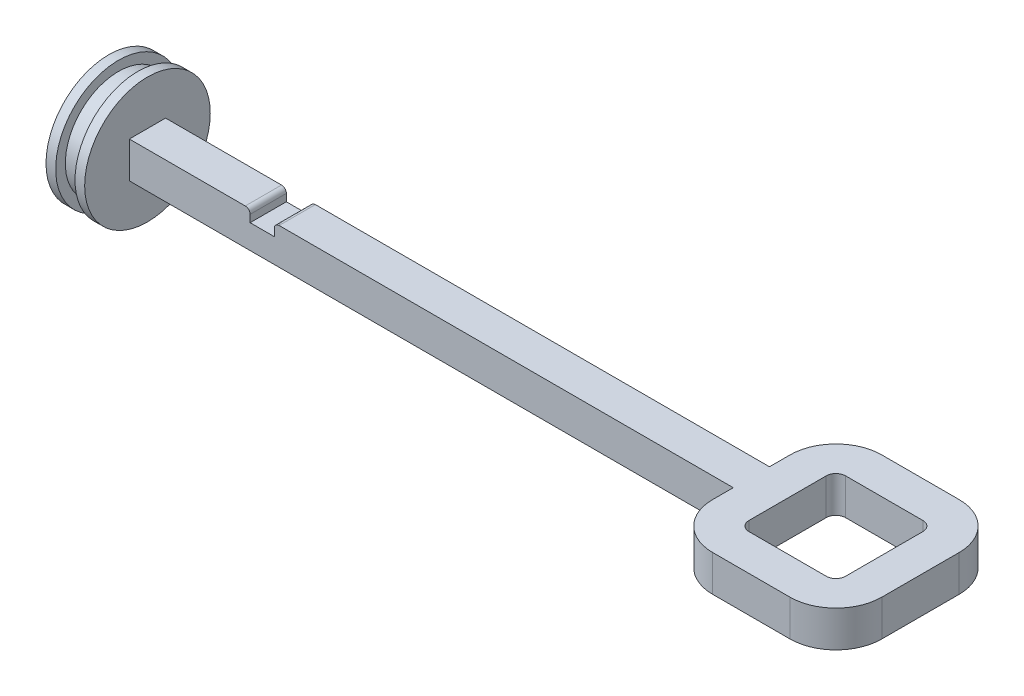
from build123d import *

# Parameters (mm, degrees)
SKETCH1_W           = 20
SKETCH1_H           = 20
BOSS_EXTRUDE1_DEPTH = 3.75
SKETCH2_R           = 13
BOSS_EXTRUDE2_DEPTH = 8
SKETCH4_W           = 4
SKETCH4_H           = 2
FILLET2_R           = 9.5
FILLET3_R           = 2
SKETCH5_W           = 5
SKETCH5_H           = 2.5
CUT_EXTRUDE1_DEPTH  = 3.75
FILLET5_R           = 1


with BuildPart() as part:
    # Sketch1 → Boss-Extrude1 (new, symmetric)
    with BuildSketch(Plane(origin=(0, 0, 0), x_dir=(1, 0, 0), z_dir=(0, 1, 0))):
        Polygon((-62.5, 3.75), (62.5, 3.75), (62.5, 17.5), (97.5, 17.5), (97.5, -17.5), (62.5, -17.5), (62.5, -3.75), (-62.5, -3.75), align=None)
        with Locations((80, 0)):
            Rectangle(SKETCH1_W, SKETCH1_H, mode=Mode.SUBTRACT)
    extrude(amount=BOSS_EXTRUDE1_DEPTH, both=True)

    # Sketch2 → Boss-Extrude2 (add)
    with BuildSketch(Plane.ZY.offset(62.5)):
        Circle(SKETCH2_R)
    extrude(amount=BOSS_EXTRUDE2_DEPTH)

    # Sketch4 → Cut-Revolve1 (revolve, cut)
    with BuildSketch(Plane.XY, mode=Mode.PRIVATE) as cut_revolve1_sk:
        with Locations((-66.5, 12)):
            Rectangle(SKETCH4_W, SKETCH4_H)
    revolve(cut_revolve1_sk.sketch.rotate(Axis((0, 0, 0), (-1, 0, 0)), 90), axis=Axis((0, 0, 0), (-1, 0, 0)), mode=Mode.SUBTRACT)

    # Fillet2
    fillet2_edges = [part.edges().sort_by_distance(p)[0] for p in [
        (62.5, 0, -17.5),
        (97.5, 0, -17.5),
        (97.5, 0, 17.5),
        (62.5, 0, 17.5),
    ]]
    fillet(fillet2_edges, radius=FILLET2_R)

    # Fillet3
    fillet3_edges = [part.edges().sort_by_distance(p)[0] for p in [
        (70, 0, 10),
        (90, 0, 10),
        (90, 0, -10),
        (70, 0, -10),
    ]]
    fillet(fillet3_edges, radius=FILLET3_R)

    # Sketch5 → Cut-Extrude1 (cut, symmetric)
    with BuildSketch(Plane.XY):
        with Locations((-35, 2.5)):
            Rectangle(SKETCH5_W, SKETCH5_H)
    extrude(amount=CUT_EXTRUDE1_DEPTH, both=True, mode=Mode.SUBTRACT)

    # Fillet5
    fillet5_edges = [part.edges().sort_by_distance(p)[0] for p in [
        (-37.5, 3.75, 0),
        (-32.5, 3.75, 0),
    ]]
    fillet(fillet5_edges, radius=FILLET5_R)


solid = part.part
